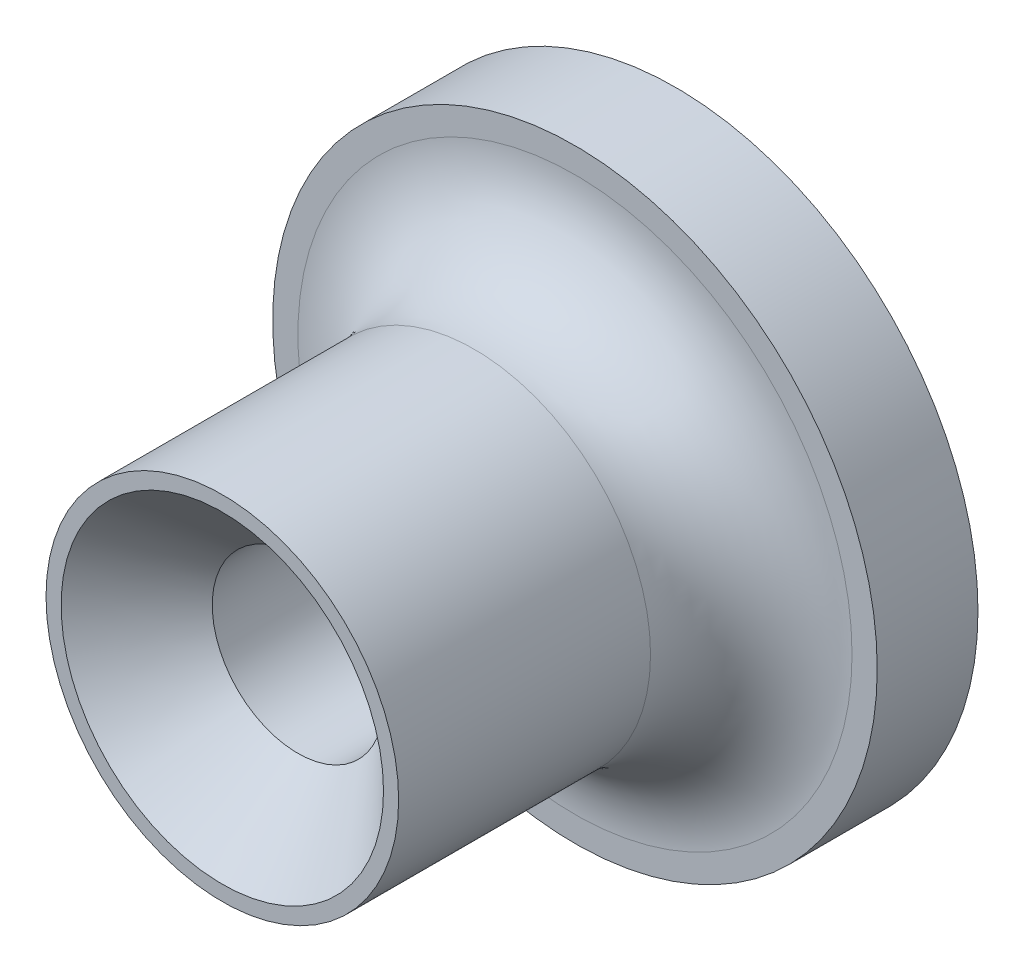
from build123d import *

# Parameters (mm, degrees)
SKETCH1_R                                       = 3.5
SKETCH1_R_2                                     = 1.7
BOSS_EXTRUDE1_DEPTH                             = 9
CSK_FOR_M3_FLAT_HEAD_MACHINE_SCREW1_D           = 3.4
CSK_FOR_M3_FLAT_HEAD_MACHINE_SCREW1_DEPTH       = 3
CSK_FOR_M3_FLAT_HEAD_MACHINE_SCREW1_CSINK_D     = 6.4
CSK_FOR_M3_FLAT_HEAD_MACHINE_SCREW1_CSINK_ANGLE = 90
CSK_FOR_M3_FLAT_HEAD_MACHINE_SCREW1_TIP         = 1.021463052
SKETCH4_R                                       = 6
SKETCH4_R_2                                     = 1.7
BOSS_EXTRUDE2_DEPTH                             = 2
FILLET1_R                                       = 2


with BuildPart() as part:
    # Sketch1 → Boss-Extrude1 (new body)
    with BuildSketch(Plane.XY):
        with Locations((-12.794959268, 3.518613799)):
            Circle(SKETCH1_R)
        with Locations((-12.794959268, 3.518613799)):
            Circle(SKETCH1_R_2, mode=Mode.SUBTRACT)
    extrude(amount=BOSS_EXTRUDE1_DEPTH)

    # CSK for M3 Flat Head Machine Screw1
    with Locations(Plane.XY.offset(9)):
        with Locations((-12.794959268, 3.518613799)):
            CounterSinkHole(CSK_FOR_M3_FLAT_HEAD_MACHINE_SCREW1_D / 2, CSK_FOR_M3_FLAT_HEAD_MACHINE_SCREW1_CSINK_D / 2, depth=CSK_FOR_M3_FLAT_HEAD_MACHINE_SCREW1_DEPTH, counter_sink_angle=CSK_FOR_M3_FLAT_HEAD_MACHINE_SCREW1_CSINK_ANGLE)
            with Locations((0, 0, -(CSK_FOR_M3_FLAT_HEAD_MACHINE_SCREW1_DEPTH + CSK_FOR_M3_FLAT_HEAD_MACHINE_SCREW1_TIP / 2))):  # 118° drill point
                Cone(0, CSK_FOR_M3_FLAT_HEAD_MACHINE_SCREW1_D / 2, CSK_FOR_M3_FLAT_HEAD_MACHINE_SCREW1_TIP, mode=Mode.SUBTRACT)

    # Sketch4 → Boss-Extrude2 (add)
    with BuildSketch(Plane.XY):
        with Locations((-12.794959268, 3.518613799)):
            Circle(SKETCH4_R)
        with Locations((-12.794959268, 3.518613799)):
            Circle(SKETCH4_R_2, mode=Mode.SUBTRACT)
    extrude(amount=BOSS_EXTRUDE2_DEPTH)

    # Fillet1
    fillet1_edges = [part.edges().sort_by_distance(p)[0] for p in [
        (-16.294959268, 3.518613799, 2),
    ]]
    fillet(fillet1_edges, radius=FILLET1_R)


solid = part.part
